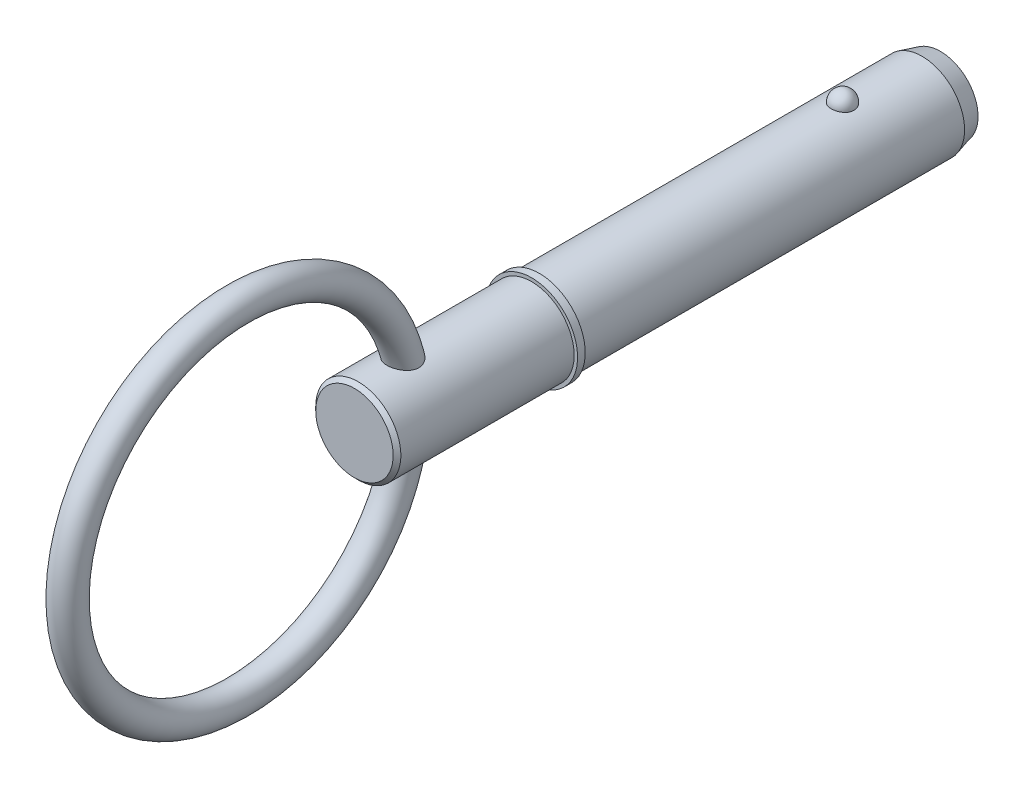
from build123d import *

# Parameters (mm, degrees)
SKETCH2_R           = 5.555
BOSS_EXTRUDE1_DEPTH = 38.1
BOSS_EXTRUDE2_START = 14.27
SKETCH3_R           = 5.555
BOSS_EXTRUDE2_DEPTH = 14.27
CHAMFER1_SIZE       = 2.4
CHAMFER1_SIZE2      = 0.643078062
SKETCH20_W          = 1
SKETCH20_H          = 6
SKETCH21_R          = 5.555
BOSS_EXTRUDE3_DEPTH = 24.13
CHAMFER2_SIZE       = 0.5
SKETCH24_R          = 2


with BuildPart() as part:
    # Sketch2 → Boss-Extrude1 (new body)
    with BuildSketch(Plane.XY):
        with Locations(Location((0, 0, 0), (0, 0, 180))):
            Circle(SKETCH2_R)
    extrude(amount=BOSS_EXTRUDE1_DEPTH)

    # Sketch3 → Boss-Extrude2 (add)
    with BuildSketch(Plane(origin=(0, 0, 0), x_dir=(-1, 0, 0), z_dir=(0, 0, -1)).offset(BOSS_EXTRUDE2_START)):
        Circle(SKETCH3_R)
    extrude(amount=-BOSS_EXTRUDE2_DEPTH)

    # Chamfer1
    chamfer1_edges = [part.edges().sort_by_distance(p)[0] for p in [
        (5.555, 0, -14.27),
    ]]
    chamfer1_side = [part.faces().sort_by_distance(p)[0] for p in [
        (5.555, 0, 11.915),
    ]]
    chamfer(chamfer1_edges, length=CHAMFER1_SIZE, length2=CHAMFER1_SIZE2, reference=chamfer1_side[0])

    # Sketch18 → Revolve1 (revolve)
    with BuildSketch(Plane(origin=(0, 0, 0), x_dir=(0, 0, -1), z_dir=(1, 0, 0))):
        with BuildLine():
            Line((1.49, 7.045), (1.49, 4.065))
            ThreePointArc((1.49, 4.065), (0, 5.555), (1.49, 7.045))
        make_face()
    revolve(axis=Axis((0, 7.045, -1.49), (0, -1, 0)))

    # Sketch20 → Revolve2 (revolve)
    with BuildSketch(Plane(origin=(0, 0, 0), x_dir=(0, 0, -1), z_dir=(1, 0, 0)), mode=Mode.PRIVATE) as revolve2_sk:
        with Locations((-38.6, 3)):
            Rectangle(SKETCH20_W, SKETCH20_H)
    revolve(revolve2_sk.sketch.rotate(Axis((0, 0, 33.728787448), (0, 0, 1)), 90), axis=Axis((0, 0, 33.728787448), (0, 0, 1)))

    # Sketch21 → Boss-Extrude3 (add)
    with BuildSketch(Plane(origin=(0, 0, 38.1), x_dir=(-1, 0, 0), z_dir=(0, 0, -1))):
        Circle(SKETCH21_R)
    extrude(amount=-BOSS_EXTRUDE3_DEPTH)

    # Chamfer2
    chamfer2_edges = [part.edges().sort_by_distance(p)[0] for p in [
        (5.555, 0, 62.23),
    ]]
    chamfer(chamfer2_edges, length=CHAMFER2_SIZE)

    # Sweep1: sweep along a path in Sketch23
    with BuildLine(Plane(origin=(0, 0, 0), x_dir=(0, 0, -1), z_dir=(1, 0, 0))) as sweep1_path:
        CenterArc((-77.455, 0), 22.225, 0, 360)
    # Sketch24 → Sweep1 (sweep)
    with BuildSketch(Plane(origin=(0, 0, 0), x_dir=(1, 0, 0), z_dir=(0, 1, 0))):
        with Locations((0, -55.23)):
            Circle(SKETCH24_R)
    sweep(path=sweep1_path.line)


solid = part.part
